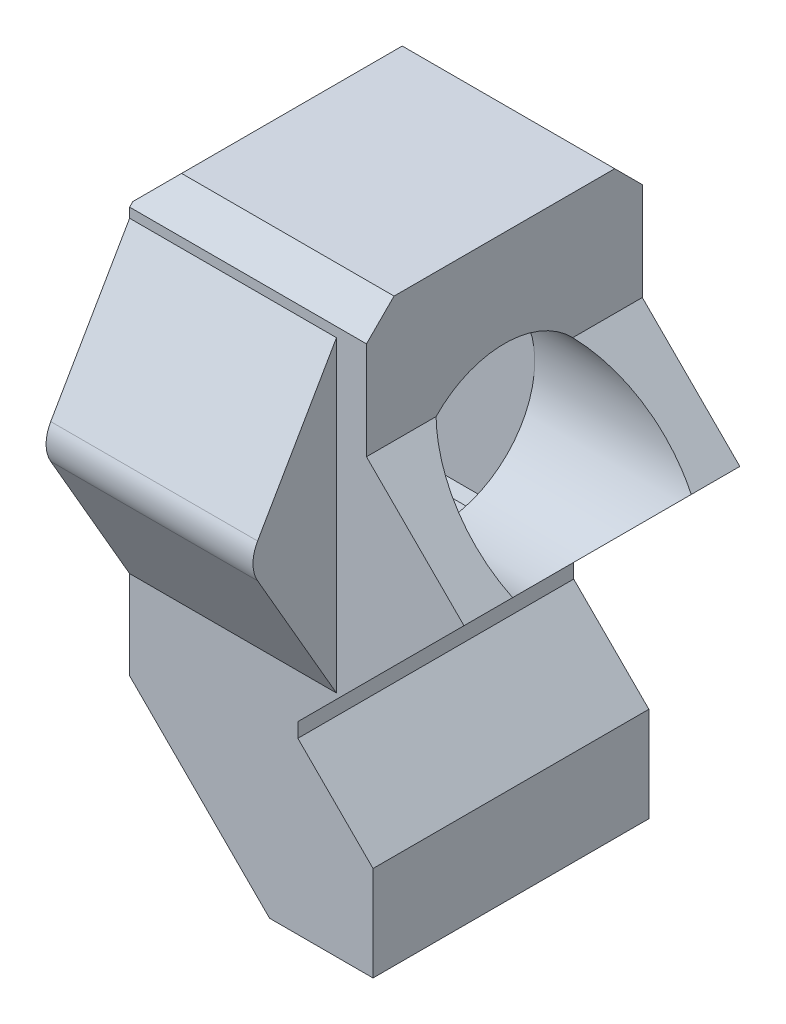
ISO-10303-21;
HEADER;
FILE_DESCRIPTION(('STEP AP214'),'2;1');
FILE_NAME('part.step','',(''),(''),'','','');
FILE_SCHEMA(('AUTOMOTIVE_DESIGN { 1 0 10303 214 1 1 1 1 }'));
ENDSEC;
DATA;
#1=APPLICATION_CONTEXT('core data for automotive mechanical design processes');
#2=APPLICATION_PROTOCOL_DEFINITION('international standard','automotive_design',2000,#1);
#3=PRODUCT_CONTEXT('',#1,'mechanical');
#4=PRODUCT('Part','Part','',(#3));
#5=PRODUCT_RELATED_PRODUCT_CATEGORY('part','',(#4));
#6=PRODUCT_DEFINITION_FORMATION('','',#4);
#7=PRODUCT_DEFINITION_CONTEXT('part definition',#1,'design');
#8=PRODUCT_DEFINITION('design','',#6,#7);
#9=PRODUCT_DEFINITION_SHAPE('','',#8);
#10=(LENGTH_UNIT() NAMED_UNIT(*) SI_UNIT(.MILLI.,.METRE.));
#11=(NAMED_UNIT(*) PLANE_ANGLE_UNIT() SI_UNIT($,.RADIAN.));
#12=(NAMED_UNIT(*) SI_UNIT($,.STERADIAN.) SOLID_ANGLE_UNIT());
#13=UNCERTAINTY_MEASURE_WITH_UNIT(LENGTH_MEASURE(1.E-05),#10,'distance_accuracy_value','');
#14=(GEOMETRIC_REPRESENTATION_CONTEXT(3) GLOBAL_UNCERTAINTY_ASSIGNED_CONTEXT((#13)) GLOBAL_UNIT_ASSIGNED_CONTEXT((#10,
#11,#12)) REPRESENTATION_CONTEXT('',''));
#15=CARTESIAN_POINT('',(0.,0.,0.));
#16=DIRECTION('',(0.,0.,1.));
#17=DIRECTION('',(1.,0.,0.));
#18=AXIS2_PLACEMENT_3D('',#15,#16,#17);
#19=CARTESIAN_POINT('',(79.1992941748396,14.5959743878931,17.7779058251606));
#20=DIRECTION('',(0.,0.,-1.));
#21=DIRECTION('',(-1.,0.,0.));
#22=AXIS2_PLACEMENT_3D('',#19,#20,#21);
#23=PLANE('',#22);
#24=DIRECTION('',(1.,0.,0.));
#25=VECTOR('',#24,1.);
#26=CARTESIAN_POINT('',(-9.4217749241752,13.223875,17.7779058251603));
#27=LINE('',#26,#25);
#28=CARTESIAN_POINT('',(2.99929417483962,13.223875,17.7779058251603));
#29=VERTEX_POINT('',#28);
#30=CARTESIAN_POINT('',(10.6192941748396,13.223875,17.7779058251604));
#31=VERTEX_POINT('',#30);
#32=EDGE_CURVE('E228',#29,#31,#27,.T.);
#33=ORIENTED_EDGE('',*,*,#32,.T.);
#34=DIRECTION('',(0.,1.,0.));
#35=VECTOR('',#34,1.);
#36=CARTESIAN_POINT('',(10.6192941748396,13.223875,17.7779058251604));
#37=LINE('',#36,#35);
#38=CARTESIAN_POINT('',(10.6192941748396,1.889125,17.7779058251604));
#39=VERTEX_POINT('',#38);
#40=EDGE_CURVE('E232',#39,#31,#37,.T.);
#41=ORIENTED_EDGE('',*,*,#40,.F.);
#42=DIRECTION('',(1.,0.,0.));
#43=VECTOR('',#42,1.);
#44=CARTESIAN_POINT('',(-9.4217749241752,1.889125,17.7779058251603));
#45=LINE('',#44,#43);
#46=CARTESIAN_POINT('',(2.99929417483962,1.889125,17.7779058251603));
#47=VERTEX_POINT('',#46);
#48=EDGE_CURVE('E240',#47,#39,#45,.T.);
#49=ORIENTED_EDGE('',*,*,#48,.F.);
#50=DIRECTION('',(0.,-1.,0.));
#51=VECTOR('',#50,1.);
#52=CARTESIAN_POINT('',(2.99929417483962,14.5959743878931,17.7779058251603));
#53=LINE('',#52,#51);
#54=CARTESIAN_POINT('',(2.99929417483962,-1.3716,17.7779058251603));
#55=VERTEX_POINT('',#54);
#56=EDGE_CURVE('E315',#47,#55,#53,.T.);
#57=ORIENTED_EDGE('',*,*,#56,.T.);
#58=DIRECTION('',(-0.707106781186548,0.707106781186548,0.));
#59=VECTOR('',#58,1.);
#60=CARTESIAN_POINT('',(8.15549417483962,-6.5278,17.7779058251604));
#61=LINE('',#60,#59);
#62=CARTESIAN_POINT('',(8.15549417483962,-6.5278,17.7779058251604));
#63=VERTEX_POINT('',#62);
#64=EDGE_CURVE('E379',#63,#55,#61,.T.);
#65=ORIENTED_EDGE('',*,*,#64,.F.);
#66=DIRECTION('',(-1.,0.,0.));
#67=VECTOR('',#66,1.);
#68=CARTESIAN_POINT('',(11.9654941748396,-6.5278,17.7779058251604));
#69=LINE('',#68,#67);
#70=CARTESIAN_POINT('',(11.9654941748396,-6.5278,17.7779058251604));
#71=VERTEX_POINT('',#70);
#72=EDGE_CURVE('E375',#71,#63,#69,.T.);
#73=ORIENTED_EDGE('',*,*,#72,.F.);
#74=DIRECTION('',(0.,-1.,0.));
#75=VECTOR('',#74,1.);
#76=CARTESIAN_POINT('',(11.9654941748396,-3.03530000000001,17.7779058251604));
#77=LINE('',#76,#75);
#78=CARTESIAN_POINT('',(11.9654941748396,-3.03530000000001,17.7779058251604));
#79=VERTEX_POINT('',#78);
#80=EDGE_CURVE('E371',#79,#71,#77,.T.);
#81=ORIENTED_EDGE('',*,*,#80,.F.);
#82=DIRECTION('',(0.707106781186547,-0.707106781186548,0.));
#83=VECTOR('',#82,1.);
#84=CARTESIAN_POINT('',(9.19689417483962,-0.266700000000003,17.7779058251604));
#85=LINE('',#84,#83);
#86=CARTESIAN_POINT('',(9.19689417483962,-0.266700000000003,17.7779058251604));
#87=VERTEX_POINT('',#86);
#88=EDGE_CURVE('E367',#87,#79,#85,.T.);
#89=ORIENTED_EDGE('',*,*,#88,.F.);
#90=DIRECTION('',(0.,-1.,0.));
#91=VECTOR('',#90,1.);
#92=CARTESIAN_POINT('',(9.19689417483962,0.266699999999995,17.7779058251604));
#93=LINE('',#92,#91);
#94=CARTESIAN_POINT('',(9.19689417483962,0.266699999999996,17.7779058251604));
#95=VERTEX_POINT('',#94);
#96=EDGE_CURVE('E363',#95,#87,#93,.T.);
#97=ORIENTED_EDGE('',*,*,#96,.F.);
#98=DIRECTION('',(-0.707106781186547,-0.707106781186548,0.));
#99=VECTOR('',#98,1.);
#100=CARTESIAN_POINT('',(15.3162966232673,6.38610244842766,17.7779058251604));
#101=LINE('',#100,#99);
#102=CARTESIAN_POINT('',(15.3162966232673,6.38610244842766,17.7779058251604));
#103=VERTEX_POINT('',#102);
#104=EDGE_CURVE('E359',#103,#95,#101,.T.);
#105=ORIENTED_EDGE('',*,*,#104,.F.);
#106=DIRECTION('',(0.707106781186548,-0.707106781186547,0.));
#107=VECTOR('',#106,1.);
#108=CARTESIAN_POINT('',(11.7241941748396,9.97820489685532,17.7779058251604));
#109=LINE('',#108,#107);
#110=CARTESIAN_POINT('',(11.7241941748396,9.97820489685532,17.7779058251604));
#111=VERTEX_POINT('',#110);
#112=EDGE_CURVE('E352',#111,#103,#109,.T.);
#113=ORIENTED_EDGE('',*,*,#112,.F.);
#114=DIRECTION('',(0.,-1.,0.));
#115=VECTOR('',#114,1.);
#116=CARTESIAN_POINT('',(11.7241941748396,12.319,17.7779058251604));
#117=LINE('',#116,#115);
#118=CARTESIAN_POINT('',(11.7241941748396,13.5799743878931,17.7779058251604));
#119=VERTEX_POINT('',#118);
#120=EDGE_CURVE('E356',#119,#111,#117,.T.);
#121=ORIENTED_EDGE('',*,*,#120,.F.);
#122=DIRECTION('',(-1.,0.,0.));
#123=VECTOR('',#122,1.);
#124=CARTESIAN_POINT('',(79.1992941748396,13.5799743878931,17.7779058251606));
#125=LINE('',#124,#123);
#126=CARTESIAN_POINT('',(2.99929417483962,13.5799743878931,17.7779058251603));
#127=VERTEX_POINT('',#126);
#128=EDGE_CURVE('E504',#119,#127,#125,.T.);
#129=ORIENTED_EDGE('',*,*,#128,.T.);
#130=EDGE_CURVE('E235',#127,#29,#53,.T.);
#131=ORIENTED_EDGE('',*,*,#130,.T.);
#132=EDGE_LOOP('',(#33,#41,#49,#57,#65,#73,#81,#89,#97,#105,#113,#121,#129,#131));
#133=FACE_BOUND('',#132,.T.);
#134=ADVANCED_FACE('F53',(#133),#23,.F.);
#135=CARTESIAN_POINT('',(9.34929417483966,0.,5.07790582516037));
#136=DIRECTION('',(-1.,0.,0.));
#137=DIRECTION('',(0.,0.,1.));
#138=AXIS2_PLACEMENT_3D('',#135,#136,#137);
#139=PLANE('',#138);
#140=DIRECTION('',(0.,-0.866025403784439,-0.499999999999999));
#141=VECTOR('',#140,1.);
#142=CARTESIAN_POINT('',(9.34929417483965,13.223875,9.42584534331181));
#143=LINE('',#142,#141);
#144=CARTESIAN_POINT('',(9.34929417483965,13.223875,9.42584534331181));
#145=VERTEX_POINT('',#144);
#146=CARTESIAN_POINT('',(9.34929417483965,12.8420625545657,9.20540582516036));
#147=VERTEX_POINT('',#146);
#148=EDGE_CURVE('E438',#145,#147,#143,.T.);
#149=ORIENTED_EDGE('',*,*,#148,.T.);
#150=DIRECTION('',(0.,1.,0.));
#151=VECTOR('',#150,1.);
#152=CARTESIAN_POINT('',(9.34929417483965,12.8420625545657,9.20540582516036));
#153=LINE('',#152,#151);
#154=CARTESIAN_POINT('',(9.34929417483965,7.5565,9.20540582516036));
#155=VERTEX_POINT('',#154);
#156=EDGE_CURVE('E264',#155,#147,#153,.T.);
#157=ORIENTED_EDGE('',*,*,#156,.F.);
#158=CARTESIAN_POINT('',(9.34929417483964,7.5565,12.6979058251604));
#159=DIRECTION('',(-1.,0.,0.));
#160=DIRECTION('',(0.,0.,1.));
#161=AXIS2_PLACEMENT_3D('',#158,#159,#160);
#162=CIRCLE('',#161,3.4925);
#163=EDGE_CURVE('E391',#155,#155,#162,.F.);
#164=ORIENTED_EDGE('',*,*,#163,.T.);
#165=CARTESIAN_POINT('',(9.34929417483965,2.27093744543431,9.20540582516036));
#166=VERTEX_POINT('',#165);
#167=EDGE_CURVE('E275',#166,#155,#153,.T.);
#168=ORIENTED_EDGE('',*,*,#167,.F.);
#169=DIRECTION('',(0.,-0.866025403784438,0.5));
#170=VECTOR('',#169,1.);
#171=CARTESIAN_POINT('',(9.34929417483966,7.5565,6.15378486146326));
#172=LINE('',#171,#170);
#173=CARTESIAN_POINT('',(9.34929417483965,1.889125,9.42584534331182));
#174=VERTEX_POINT('',#173);
#175=EDGE_CURVE('E442',#166,#174,#172,.T.);
#176=ORIENTED_EDGE('',*,*,#175,.T.);
#177=DIRECTION('',(0.,0.,1.));
#178=VECTOR('',#177,1.);
#179=CARTESIAN_POINT('',(9.34929417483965,1.889125,9.42584534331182));
#180=LINE('',#179,#178);
#181=CARTESIAN_POINT('',(9.34929417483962,1.889125,15.9699663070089));
#182=VERTEX_POINT('',#181);
#183=EDGE_CURVE('E445',#174,#182,#180,.T.);
#184=ORIENTED_EDGE('',*,*,#183,.T.);
#185=DIRECTION('',(0.,0.866025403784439,0.499999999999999));
#186=VECTOR('',#185,1.);
#187=CARTESIAN_POINT('',(9.34929417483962,1.889125,15.9699663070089));
#188=LINE('',#187,#186);
#189=CARTESIAN_POINT('',(9.34929417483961,7.55650000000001,19.2420267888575));
#190=VERTEX_POINT('',#189);
#191=EDGE_CURVE('E449',#182,#190,#188,.T.);
#192=ORIENTED_EDGE('',*,*,#191,.T.);
#193=DIRECTION('',(0.,0.866025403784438,-0.5));
#194=VECTOR('',#193,1.);
#195=CARTESIAN_POINT('',(9.34929417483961,7.5565,19.2420267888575));
#196=LINE('',#195,#194);
#197=CARTESIAN_POINT('',(9.34929417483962,13.223875,15.9699663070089));
#198=VERTEX_POINT('',#197);
#199=EDGE_CURVE('E411',#190,#198,#196,.T.);
#200=ORIENTED_EDGE('',*,*,#199,.T.);
#201=DIRECTION('',(0.,0.,-1.));
#202=VECTOR('',#201,1.);
#203=CARTESIAN_POINT('',(9.34929417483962,13.223875,15.9699663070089));
#204=LINE('',#203,#202);
#205=EDGE_CURVE('E434',#198,#145,#204,.T.);
#206=ORIENTED_EDGE('',*,*,#205,.T.);
#207=EDGE_LOOP('',(#149,#157,#164,#168,#176,#184,#192,#200,#206));
#208=FACE_BOUND('',#207,.T.);
#209=ADVANCED_FACE('F532',(#208),#139,.T.);
#210=CARTESIAN_POINT('',(-14.3148224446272,7.5565,6.15378486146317));
#211=DIRECTION('',(0.,0.5,0.866025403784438));
#212=DIRECTION('',(0.,0.866025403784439,-0.5));
#213=AXIS2_PLACEMENT_3D('',#210,#211,#212);
#214=PLANE('',#213);
#215=ORIENTED_EDGE('',*,*,#175,.F.);
#216=DIRECTION('',(1.,0.,0.));
#217=VECTOR('',#216,1.);
#218=CARTESIAN_POINT('',(-7.69036635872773,2.27093744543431,9.20540582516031));
#219=LINE('',#218,#217);
#220=CARTESIAN_POINT('',(2.99929417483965,2.27093744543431,9.20540582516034));
#221=VERTEX_POINT('',#220);
#222=EDGE_CURVE('E274',#221,#166,#219,.T.);
#223=ORIENTED_EDGE('',*,*,#222,.F.);
#224=DIRECTION('',(0.,0.866025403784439,-0.5));
#225=VECTOR('',#224,1.);
#226=CARTESIAN_POINT('',(2.99929417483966,7.5565,6.15378486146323));
#227=LINE('',#226,#225);
#228=CARTESIAN_POINT('',(2.99929417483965,1.889125,9.42584534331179));
#229=VERTEX_POINT('',#228);
#230=EDGE_CURVE('E416',#229,#221,#227,.T.);
#231=ORIENTED_EDGE('',*,*,#230,.F.);
#232=DIRECTION('',(1.,0.,0.));
#233=VECTOR('',#232,1.);
#234=CARTESIAN_POINT('',(-14.3148224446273,1.889125,9.42584534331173));
#235=LINE('',#234,#233);
#236=EDGE_CURVE('E456',#229,#174,#235,.T.);
#237=ORIENTED_EDGE('',*,*,#236,.T.);
#238=EDGE_LOOP('',(#215,#223,#231,#237));
#239=FACE_BOUND('',#238,.T.);
#240=ADVANCED_FACE('F545',(#239),#214,.T.);
#241=CARTESIAN_POINT('',(-14.3148224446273,13.223875,9.42584534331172));
#242=DIRECTION('',(0.,-0.499999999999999,0.866025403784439));
#243=DIRECTION('',(0.,0.866025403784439,0.5));
#244=AXIS2_PLACEMENT_3D('',#241,#242,#243);
#245=PLANE('',#244);
#246=DIRECTION('',(0.,0.866025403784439,0.5));
#247=VECTOR('',#246,1.);
#248=CARTESIAN_POINT('',(2.99929417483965,13.223875,9.42584534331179));
#249=LINE('',#248,#247);
#250=CARTESIAN_POINT('',(2.99929417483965,12.8420625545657,9.20540582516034));
#251=VERTEX_POINT('',#250);
#252=CARTESIAN_POINT('',(2.99929417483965,13.223875,9.42584534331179));
#253=VERTEX_POINT('',#252);
#254=EDGE_CURVE('E421',#251,#253,#249,.T.);
#255=ORIENTED_EDGE('',*,*,#254,.F.);
#256=DIRECTION('',(1.,0.,0.));
#257=VECTOR('',#256,1.);
#258=CARTESIAN_POINT('',(-7.69036635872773,12.8420625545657,9.20540582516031));
#259=LINE('',#258,#257);
#260=EDGE_CURVE('E278',#251,#147,#259,.T.);
#261=ORIENTED_EDGE('',*,*,#260,.T.);
#262=ORIENTED_EDGE('',*,*,#148,.F.);
#263=DIRECTION('',(1.,0.,0.));
#264=VECTOR('',#263,1.);
#265=CARTESIAN_POINT('',(-14.3148224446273,13.223875,9.42584534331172));
#266=LINE('',#265,#264);
#267=EDGE_CURVE('E460',#253,#145,#266,.T.);
#268=ORIENTED_EDGE('',*,*,#267,.F.);
#269=EDGE_LOOP('',(#255,#261,#262,#268));
#270=FACE_BOUND('',#269,.T.);
#271=ADVANCED_FACE('F530',(#270),#245,.T.);
#272=CARTESIAN_POINT('',(2.99929417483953,-1.3716,42.832577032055));
#273=DIRECTION('',(1.,0.,0.));
#274=DIRECTION('',(0.,0.,-1.));
#275=AXIS2_PLACEMENT_3D('',#272,#273,#274);
#276=PLANE('',#275);
#277=DIRECTION('',(0.,0.,1.));
#278=VECTOR('',#277,1.);
#279=CARTESIAN_POINT('',(2.99929417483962,13.223875,15.9699663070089));
#280=LINE('',#279,#278);
#281=CARTESIAN_POINT('',(2.99929417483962,13.223875,15.9699663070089));
#282=VERTEX_POINT('',#281);
#283=EDGE_CURVE('E424',#253,#282,#280,.T.);
#284=ORIENTED_EDGE('',*,*,#283,.T.);
#285=DIRECTION('',(0.,-0.866025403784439,0.5));
#286=VECTOR('',#285,1.);
#287=CARTESIAN_POINT('',(2.99929417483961,7.5565,19.2420267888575));
#288=LINE('',#287,#286);
#289=CARTESIAN_POINT('',(2.99929417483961,7.55650000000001,19.2420267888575));
#290=VERTEX_POINT('',#289);
#291=EDGE_CURVE('E428',#282,#290,#288,.T.);
#292=ORIENTED_EDGE('',*,*,#291,.T.);
#293=DIRECTION('',(0.,-0.866025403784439,-0.5));
#294=VECTOR('',#293,1.);
#295=CARTESIAN_POINT('',(2.99929417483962,1.889125,15.9699663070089));
#296=LINE('',#295,#294);
#297=CARTESIAN_POINT('',(2.99929417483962,1.889125,15.9699663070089));
#298=VERTEX_POINT('',#297);
#299=EDGE_CURVE('E417',#290,#298,#296,.T.);
#300=ORIENTED_EDGE('',*,*,#299,.T.);
#301=DIRECTION('',(0.,0.,-1.));
#302=VECTOR('',#301,1.);
#303=CARTESIAN_POINT('',(2.99929417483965,1.889125,9.42584534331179));
#304=LINE('',#303,#302);
#305=EDGE_CURVE('E412',#298,#229,#304,.T.);
#306=ORIENTED_EDGE('',*,*,#305,.T.);
#307=ORIENTED_EDGE('',*,*,#230,.T.);
#308=DIRECTION('',(0.,-1.,0.));
#309=VECTOR('',#308,1.);
#310=CARTESIAN_POINT('',(2.99929417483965,12.8420625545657,9.20540582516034));
#311=LINE('',#310,#309);
#312=EDGE_CURVE('E270',#251,#221,#311,.T.);
#313=ORIENTED_EDGE('',*,*,#312,.F.);
#314=ORIENTED_EDGE('',*,*,#254,.T.);
#315=EDGE_LOOP('',(#284,#292,#300,#306,#307,#313,#314));
#316=FACE_BOUND('',#315,.T.);
#317=DIRECTION('',(0.,-0.866025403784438,-0.500000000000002));
#318=VECTOR('',#317,1.);
#319=CARTESIAN_POINT('',(2.99929417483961,7.55650000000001,21.0499663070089));
#320=LINE('',#319,#318);
#321=CARTESIAN_POINT('',(2.99929417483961,6.92150000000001,20.6833488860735));
#322=VERTEX_POINT('',#321);
#323=EDGE_CURVE('E261',#322,#47,#320,.T.);
#324=ORIENTED_EDGE('',*,*,#323,.F.);
#325=CARTESIAN_POINT('',(2.99929417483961,7.55650000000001,19.5834966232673));
#326=DIRECTION('',(1.,0.,0.));
#327=DIRECTION('',(0.,0.,-1.));
#328=AXIS2_PLACEMENT_3D('',#325,#326,#327);
#329=CIRCLE('',#328,1.27);
#330=CARTESIAN_POINT('',(2.99929417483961,8.19150000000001,20.6833488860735));
#331=VERTEX_POINT('',#330);
#332=EDGE_CURVE('E12',#322,#331,#329,.F.);
#333=ORIENTED_EDGE('',*,*,#332,.T.);
#334=DIRECTION('',(0.,-0.866025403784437,0.500000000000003));
#335=VECTOR('',#334,1.);
#336=CARTESIAN_POINT('',(2.99929417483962,13.223875,17.7779058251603));
#337=LINE('',#336,#335);
#338=EDGE_CURVE('E258',#29,#331,#337,.T.);
#339=ORIENTED_EDGE('',*,*,#338,.F.);
#340=ORIENTED_EDGE('',*,*,#130,.F.);
#341=DIRECTION('',(0.,0.707106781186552,-0.707106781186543));
#342=VECTOR('',#341,1.);
#343=CARTESIAN_POINT('',(2.99929417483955,-6.4231484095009,37.7810286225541));
#344=LINE('',#343,#342);
#345=CARTESIAN_POINT('',(2.99929417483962,13.6979487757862,17.6599314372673));
#346=VERTEX_POINT('',#345);
#347=EDGE_CURVE('E294',#127,#346,#344,.T.);
#348=ORIENTED_EDGE('',*,*,#347,.T.);
#349=DIRECTION('',(0.,0.,-1.));
#350=VECTOR('',#349,1.);
#351=CARTESIAN_POINT('',(2.99929417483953,13.6979487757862,43.6184851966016));
#352=LINE('',#351,#350);
#353=CARTESIAN_POINT('',(2.99929417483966,13.6979487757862,7.73588021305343));
#354=VERTEX_POINT('',#353);
#355=EDGE_CURVE('E431',#346,#354,#352,.T.);
#356=ORIENTED_EDGE('',*,*,#355,.T.);
#357=DIRECTION('',(0.,-0.707106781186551,-0.707106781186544));
#358=VECTOR('',#357,1.);
#359=CARTESIAN_POINT('',(2.99929417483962,23.7115227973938,17.749454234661));
#360=LINE('',#359,#358);
#361=CARTESIAN_POINT('',(2.99929417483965,13.5799743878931,7.61790582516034));
#362=VERTEX_POINT('',#361);
#363=EDGE_CURVE('E306',#354,#362,#360,.T.);
#364=ORIENTED_EDGE('',*,*,#363,.T.);
#365=DIRECTION('',(0.,1.,0.));
#366=VECTOR('',#365,1.);
#367=CARTESIAN_POINT('',(2.99929417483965,14.5959743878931,7.61790582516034));
#368=LINE('',#367,#366);
#369=CARTESIAN_POINT('',(2.99929417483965,-1.3716,7.61790582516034));
#370=VERTEX_POINT('',#369);
#371=EDGE_CURVE('E314',#370,#362,#368,.T.);
#372=ORIENTED_EDGE('',*,*,#371,.F.);
#373=DIRECTION('',(0.,0.,-1.));
#374=VECTOR('',#373,1.);
#375=CARTESIAN_POINT('',(2.99929417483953,-1.3716,42.832577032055));
#376=LINE('',#375,#374);
#377=EDGE_CURVE('E496',#55,#370,#376,.T.);
#378=ORIENTED_EDGE('',*,*,#377,.F.);
#379=ORIENTED_EDGE('',*,*,#56,.F.);
#380=EDGE_LOOP('',(#324,#333,#339,#340,#348,#356,#364,#372,#378,#379));
#381=FACE_BOUND('',#380,.T.);
#382=ADVANCED_FACE('F539',(#316,#381),#276,.F.);
#383=CARTESIAN_POINT('',(11.7241941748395,9.97820489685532,42.8325770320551));
#384=DIRECTION('',(-0.707106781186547,-0.707106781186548,0.));
#385=DIRECTION('',(0.707106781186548,-0.707106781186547,0.));
#386=AXIS2_PLACEMENT_3D('',#383,#384,#385);
#387=PLANE('',#386);
#388=DIRECTION('',(0.,0.,-1.));
#389=VECTOR('',#388,1.);
#390=CARTESIAN_POINT('',(15.3162966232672,6.38610244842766,42.8325770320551));
#391=LINE('',#390,#389);
#392=CARTESIAN_POINT('',(15.3162966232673,6.38610244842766,9.40735483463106));
#393=VERTEX_POINT('',#392);
#394=CARTESIAN_POINT('',(15.3162966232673,6.38610244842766,7.61790582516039));
#395=VERTEX_POINT('',#394);
#396=EDGE_CURVE('E472',#393,#395,#391,.T.);
#397=ORIENTED_EDGE('',*,*,#396,.T.);
#398=DIRECTION('',(-0.707106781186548,0.707106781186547,0.));
#399=VECTOR('',#398,1.);
#400=CARTESIAN_POINT('',(11.7241941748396,9.97820489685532,7.61790582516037));
#401=LINE('',#400,#399);
#402=CARTESIAN_POINT('',(11.7241941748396,9.97820489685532,7.61790582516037));
#403=VERTEX_POINT('',#402);
#404=EDGE_CURVE('E324',#395,#403,#401,.T.);
#405=ORIENTED_EDGE('',*,*,#404,.T.);
#406=DIRECTION('',(0.,0.,-1.));
#407=VECTOR('',#406,1.);
#408=CARTESIAN_POINT('',(11.7241941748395,9.97820489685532,42.8325770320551));
#409=LINE('',#408,#407);
#410=CARTESIAN_POINT('',(11.7241941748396,9.97820489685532,10.1813801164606));
#411=VERTEX_POINT('',#410);
#412=EDGE_CURVE('E500',#411,#403,#409,.T.);
#413=ORIENTED_EDGE('',*,*,#412,.F.);
#414=CARTESIAN_POINT('',(14.145899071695,7.5565,12.6979058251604));
#415=DIRECTION('',(-0.707106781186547,-0.707106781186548,0.));
#416=DIRECTION('',(0.707106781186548,-0.707106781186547,0.));
#417=AXIS2_PLACEMENT_3D('',#414,#415,#416);
#418=ELLIPSE('',#417,4.93914086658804,3.4925);
#419=EDGE_CURVE('E407',#411,#393,#418,.T.);
#420=ORIENTED_EDGE('',*,*,#419,.T.);
#421=EDGE_LOOP('',(#397,#405,#413,#420));
#422=FACE_BOUND('',#421,.T.);
#423=ADVANCED_FACE('F571',(#422),#387,.F.);
#424=CARTESIAN_POINT('',(15.3162966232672,6.38610244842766,42.8325770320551));
#425=DIRECTION('',(-0.707106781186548,0.707106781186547,0.));
#426=DIRECTION('',(-0.707106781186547,-0.707106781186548,0.));
#427=AXIS2_PLACEMENT_3D('',#424,#425,#426);
#428=PLANE('',#427);
#429=CARTESIAN_POINT('',(15.3162966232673,6.38610244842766,15.9884568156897));
#430=VERTEX_POINT('',#429);
#431=EDGE_CURVE('E473',#103,#430,#391,.T.);
#432=ORIENTED_EDGE('',*,*,#431,.F.);
#433=ORIENTED_EDGE('',*,*,#104,.T.);
#434=DIRECTION('',(0.,0.,-1.));
#435=VECTOR('',#434,1.);
#436=CARTESIAN_POINT('',(9.19689417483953,0.266699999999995,42.8325770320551));
#437=LINE('',#436,#435);
#438=CARTESIAN_POINT('',(9.19689417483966,0.266699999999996,7.61790582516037));
#439=VERTEX_POINT('',#438);
#440=EDGE_CURVE('E476',#95,#439,#437,.T.);
#441=ORIENTED_EDGE('',*,*,#440,.T.);
#442=DIRECTION('',(0.707106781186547,0.707106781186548,0.));
#443=VECTOR('',#442,1.);
#444=CARTESIAN_POINT('',(15.3162966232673,6.38610244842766,7.61790582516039));
#445=LINE('',#444,#443);
#446=EDGE_CURVE('E328',#439,#395,#445,.T.);
#447=ORIENTED_EDGE('',*,*,#446,.T.);
#448=ORIENTED_EDGE('',*,*,#396,.F.);
#449=CARTESIAN_POINT('',(16.4866941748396,7.5565,12.6979058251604));
#450=DIRECTION('',(-0.707106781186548,0.707106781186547,0.));
#451=DIRECTION('',(0.707106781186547,0.707106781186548,0.));
#452=AXIS2_PLACEMENT_3D('',#449,#450,#451);
#453=ELLIPSE('',#452,4.93914086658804,3.4925);
#454=EDGE_CURVE('E403',#393,#430,#453,.T.);
#455=ORIENTED_EDGE('',*,*,#454,.T.);
#456=EDGE_LOOP('',(#432,#433,#441,#447,#448,#455));
#457=FACE_BOUND('',#456,.T.);
#458=ADVANCED_FACE('F567',(#457),#428,.F.);
#459=CARTESIAN_POINT('',(9.19689417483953,0.266699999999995,42.8325770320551));
#460=DIRECTION('',(-1.,0.,0.));
#461=DIRECTION('',(0.,0.,1.));
#462=AXIS2_PLACEMENT_3D('',#459,#460,#461);
#463=PLANE('',#462);
#464=ORIENTED_EDGE('',*,*,#440,.F.);
#465=ORIENTED_EDGE('',*,*,#96,.T.);
#466=DIRECTION('',(0.,0.,-1.));
#467=VECTOR('',#466,1.);
#468=CARTESIAN_POINT('',(9.19689417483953,-0.266700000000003,42.8325770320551));
#469=LINE('',#468,#467);
#470=CARTESIAN_POINT('',(9.19689417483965,-0.266700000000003,7.61790582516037));
#471=VERTEX_POINT('',#470);
#472=EDGE_CURVE('E480',#87,#471,#469,.T.);
#473=ORIENTED_EDGE('',*,*,#472,.T.);
#474=DIRECTION('',(0.,1.,0.));
#475=VECTOR('',#474,1.);
#476=CARTESIAN_POINT('',(9.19689417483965,0.266699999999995,7.61790582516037));
#477=LINE('',#476,#475);
#478=EDGE_CURVE('E332',#471,#439,#477,.T.);
#479=ORIENTED_EDGE('',*,*,#478,.T.);
#480=EDGE_LOOP('',(#464,#465,#473,#479));
#481=FACE_BOUND('',#480,.T.);
#482=ADVANCED_FACE('F591',(#481),#463,.F.);
#483=CARTESIAN_POINT('',(9.19689417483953,-0.266700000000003,42.8325770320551));
#484=DIRECTION('',(-0.707106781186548,-0.707106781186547,0.));
#485=DIRECTION('',(0.707106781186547,-0.707106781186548,0.));
#486=AXIS2_PLACEMENT_3D('',#483,#484,#485);
#487=PLANE('',#486);
#488=ORIENTED_EDGE('',*,*,#472,.F.);
#489=ORIENTED_EDGE('',*,*,#88,.T.);
#490=DIRECTION('',(0.,0.,-1.));
#491=VECTOR('',#490,1.);
#492=CARTESIAN_POINT('',(11.9654941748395,-3.03530000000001,42.8325770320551));
#493=LINE('',#492,#491);
#494=CARTESIAN_POINT('',(11.9654941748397,-3.03530000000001,7.61790582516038));
#495=VERTEX_POINT('',#494);
#496=EDGE_CURVE('E484',#79,#495,#493,.T.);
#497=ORIENTED_EDGE('',*,*,#496,.T.);
#498=DIRECTION('',(-0.707106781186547,0.707106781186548,0.));
#499=VECTOR('',#498,1.);
#500=CARTESIAN_POINT('',(9.19689417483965,-0.266700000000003,7.61790582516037));
#501=LINE('',#500,#499);
#502=EDGE_CURVE('E336',#495,#471,#501,.T.);
#503=ORIENTED_EDGE('',*,*,#502,.T.);
#504=EDGE_LOOP('',(#488,#489,#497,#503));
#505=FACE_BOUND('',#504,.T.);
#506=ADVANCED_FACE('F593',(#505),#487,.F.);
#507=CARTESIAN_POINT('',(11.9654941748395,-3.03530000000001,42.8325770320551));
#508=DIRECTION('',(-1.,0.,0.));
#509=DIRECTION('',(0.,0.,1.));
#510=AXIS2_PLACEMENT_3D('',#507,#508,#509);
#511=PLANE('',#510);
#512=ORIENTED_EDGE('',*,*,#496,.F.);
#513=ORIENTED_EDGE('',*,*,#80,.T.);
#514=DIRECTION('',(0.,0.,-1.));
#515=VECTOR('',#514,1.);
#516=CARTESIAN_POINT('',(11.9654941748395,-6.5278,42.8325770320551));
#517=LINE('',#516,#515);
#518=CARTESIAN_POINT('',(11.9654941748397,-6.5278,7.61790582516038));
#519=VERTEX_POINT('',#518);
#520=EDGE_CURVE('E488',#71,#519,#517,.T.);
#521=ORIENTED_EDGE('',*,*,#520,.T.);
#522=DIRECTION('',(0.,1.,0.));
#523=VECTOR('',#522,1.);
#524=CARTESIAN_POINT('',(11.9654941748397,-3.03530000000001,7.61790582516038));
#525=LINE('',#524,#523);
#526=EDGE_CURVE('E340',#519,#495,#525,.T.);
#527=ORIENTED_EDGE('',*,*,#526,.T.);
#528=EDGE_LOOP('',(#512,#513,#521,#527));
#529=FACE_BOUND('',#528,.T.);
#530=ADVANCED_FACE('F596',(#529),#511,.F.);
#531=CARTESIAN_POINT('',(11.9654941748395,-6.5278,42.8325770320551));
#532=DIRECTION('',(0.,1.,0.));
#533=DIRECTION('',(-1.,0.,0.));
#534=AXIS2_PLACEMENT_3D('',#531,#532,#533);
#535=PLANE('',#534);
#536=ORIENTED_EDGE('',*,*,#520,.F.);
#537=ORIENTED_EDGE('',*,*,#72,.T.);
#538=DIRECTION('',(0.,0.,-1.));
#539=VECTOR('',#538,1.);
#540=CARTESIAN_POINT('',(8.15549417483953,-6.5278,42.832577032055));
#541=LINE('',#540,#539);
#542=CARTESIAN_POINT('',(8.15549417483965,-6.5278,7.61790582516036));
#543=VERTEX_POINT('',#542);
#544=EDGE_CURVE('E492',#63,#543,#541,.T.);
#545=ORIENTED_EDGE('',*,*,#544,.T.);
#546=DIRECTION('',(1.,0.,0.));
#547=VECTOR('',#546,1.);
#548=CARTESIAN_POINT('',(11.9654941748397,-6.5278,7.61790582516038));
#549=LINE('',#548,#547);
#550=EDGE_CURVE('E344',#543,#519,#549,.T.);
#551=ORIENTED_EDGE('',*,*,#550,.T.);
#552=EDGE_LOOP('',(#536,#537,#545,#551));
#553=FACE_BOUND('',#552,.T.);
#554=ADVANCED_FACE('F599',(#553),#535,.F.);
#555=CARTESIAN_POINT('',(8.15549417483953,-6.5278,42.832577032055));
#556=DIRECTION('',(0.707106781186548,0.707106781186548,0.));
#557=DIRECTION('',(-0.707106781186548,0.707106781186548,0.));
#558=AXIS2_PLACEMENT_3D('',#555,#556,#557);
#559=PLANE('',#558);
#560=ORIENTED_EDGE('',*,*,#544,.F.);
#561=ORIENTED_EDGE('',*,*,#64,.T.);
#562=ORIENTED_EDGE('',*,*,#377,.T.);
#563=DIRECTION('',(0.707106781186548,-0.707106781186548,0.));
#564=VECTOR('',#563,1.);
#565=CARTESIAN_POINT('',(8.15549417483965,-6.5278,7.61790582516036));
#566=LINE('',#565,#564);
#567=EDGE_CURVE('E348',#370,#543,#566,.T.);
#568=ORIENTED_EDGE('',*,*,#567,.T.);
#569=EDGE_LOOP('',(#560,#561,#562,#568));
#570=FACE_BOUND('',#569,.T.);
#571=ADVANCED_FACE('F602',(#570),#559,.F.);
#572=CARTESIAN_POINT('',(11.7241941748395,12.319,42.8325770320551));
#573=DIRECTION('',(-1.,0.,0.));
#574=DIRECTION('',(0.,0.,1.));
#575=AXIS2_PLACEMENT_3D('',#572,#573,#574);
#576=PLANE('',#575);
#577=DIRECTION('',(0.,0.,1.));
#578=VECTOR('',#577,1.);
#579=CARTESIAN_POINT('',(11.7241941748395,14.5959743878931,42.8325770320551));
#580=LINE('',#579,#578);
#581=CARTESIAN_POINT('',(11.7241941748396,14.5959743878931,8.63390582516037));
#582=VERTEX_POINT('',#581);
#583=CARTESIAN_POINT('',(11.7241941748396,14.5959743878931,16.7619058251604));
#584=VERTEX_POINT('',#583);
#585=EDGE_CURVE('E387',#582,#584,#580,.T.);
#586=ORIENTED_EDGE('',*,*,#585,.T.);
#587=DIRECTION('',(0.,-0.707106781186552,0.707106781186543));
#588=VECTOR('',#587,1.);
#589=CARTESIAN_POINT('',(11.7241941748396,0.422151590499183,30.9357286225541));
#590=LINE('',#589,#588);
#591=EDGE_CURVE('E298',#584,#119,#590,.T.);
#592=ORIENTED_EDGE('',*,*,#591,.T.);
#593=ORIENTED_EDGE('',*,*,#120,.T.);
#594=CARTESIAN_POINT('',(11.7241941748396,9.97820489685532,15.2144315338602));
#595=VERTEX_POINT('',#594);
#596=EDGE_CURVE('E501',#111,#595,#409,.T.);
#597=ORIENTED_EDGE('',*,*,#596,.T.);
#598=CARTESIAN_POINT('',(11.7241941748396,7.5565,12.6979058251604));
#599=DIRECTION('',(-1.,0.,0.));
#600=DIRECTION('',(0.,0.,1.));
#601=AXIS2_PLACEMENT_3D('',#598,#599,#600);
#602=CIRCLE('',#601,3.4925);
#603=EDGE_CURVE('E399',#595,#411,#602,.T.);
#604=ORIENTED_EDGE('',*,*,#603,.T.);
#605=ORIENTED_EDGE('',*,*,#412,.T.);
#606=DIRECTION('',(0.,1.,0.));
#607=VECTOR('',#606,1.);
#608=CARTESIAN_POINT('',(11.7241941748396,12.319,7.61790582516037));
#609=LINE('',#608,#607);
#610=CARTESIAN_POINT('',(11.7241941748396,13.5799743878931,7.61790582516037));
#611=VERTEX_POINT('',#610);
#612=EDGE_CURVE('E320',#403,#611,#609,.T.);
#613=ORIENTED_EDGE('',*,*,#612,.T.);
#614=DIRECTION('',(0.,0.707106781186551,0.707106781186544));
#615=VECTOR('',#614,1.);
#616=CARTESIAN_POINT('',(11.7241941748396,30.5568227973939,24.594754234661));
#617=LINE('',#616,#615);
#618=EDGE_CURVE('E310',#611,#582,#617,.T.);
#619=ORIENTED_EDGE('',*,*,#618,.T.);
#620=EDGE_LOOP('',(#586,#592,#593,#597,#604,#605,#613,#619));
#621=FACE_BOUND('',#620,.T.);
#622=ADVANCED_FACE('F572',(#621),#576,.F.);
#623=ORIENTED_EDGE('',*,*,#596,.F.);
#624=ORIENTED_EDGE('',*,*,#112,.T.);
#625=ORIENTED_EDGE('',*,*,#431,.T.);
#626=CARTESIAN_POINT('',(14.145899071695,7.5565,12.6979058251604));
#627=DIRECTION('',(-0.707106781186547,-0.707106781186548,0.));
#628=DIRECTION('',(0.707106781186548,-0.707106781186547,0.));
#629=AXIS2_PLACEMENT_3D('',#626,#627,#628);
#630=ELLIPSE('',#629,4.93914086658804,3.4925);
#631=EDGE_CURVE('E395',#430,#595,#630,.T.);
#632=ORIENTED_EDGE('',*,*,#631,.T.);
#633=EDGE_LOOP('',(#623,#624,#625,#632));
#634=FACE_BOUND('',#633,.T.);
#635=ADVANCED_FACE('F563',(#634),#387,.F.);
#636=CARTESIAN_POINT('',(2.99929417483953,13.6979487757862,43.6184851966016));
#637=DIRECTION('',(0.707106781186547,-0.707106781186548,0.));
#638=DIRECTION('',(0.707106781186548,0.707106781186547,0.));
#639=AXIS2_PLACEMENT_3D('',#636,#637,#638);
#640=PLANE('',#639);
#641=ORIENTED_EDGE('',*,*,#355,.F.);
#642=DIRECTION('',(0.577350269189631,0.577350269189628,-0.577350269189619));
#643=VECTOR('',#642,1.);
#644=CARTESIAN_POINT('',(-5.65355707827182,5.04509752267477,26.3127826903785));
#645=LINE('',#644,#643);
#646=CARTESIAN_POINT('',(3.89731978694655,14.5959743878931,16.7619058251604));
#647=VERTEX_POINT('',#646);
#648=EDGE_CURVE('E288',#346,#647,#645,.T.);
#649=ORIENTED_EDGE('',*,*,#648,.T.);
#650=DIRECTION('',(0.,0.,-1.));
#651=VECTOR('',#650,1.);
#652=CARTESIAN_POINT('',(3.89731978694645,14.5959743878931,43.6184851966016));
#653=LINE('',#652,#651);
#654=CARTESIAN_POINT('',(3.89731978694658,14.5959743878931,8.63390582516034));
#655=VERTEX_POINT('',#654);
#656=EDGE_CURVE('E383',#647,#655,#653,.T.);
#657=ORIENTED_EDGE('',*,*,#656,.T.);
#658=DIRECTION('',(-0.577350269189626,-0.577350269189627,-0.577350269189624));
#659=VECTOR('',#658,1.);
#660=CARTESIAN_POINT('',(14.960162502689,25.6588171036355,19.6967485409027));
#661=LINE('',#660,#659);
#662=EDGE_CURVE('E302',#655,#354,#661,.T.);
#663=ORIENTED_EDGE('',*,*,#662,.T.);
#664=EDGE_LOOP('',(#641,#649,#657,#663));
#665=FACE_BOUND('',#664,.T.);
#666=ADVANCED_FACE('F583',(#665),#640,.F.);
#667=CARTESIAN_POINT('',(-14.3148224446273,1.889125,15.9699663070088));
#668=DIRECTION('',(0.,0.499999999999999,-0.866025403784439));
#669=DIRECTION('',(0.,-0.866025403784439,-0.5));
#670=AXIS2_PLACEMENT_3D('',#667,#668,#669);
#671=PLANE('',#670);
#672=ORIENTED_EDGE('',*,*,#299,.F.);
#673=DIRECTION('',(1.,0.,0.));
#674=VECTOR('',#673,1.);
#675=CARTESIAN_POINT('',(-9.42177492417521,7.55650000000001,19.2420267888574));
#676=LINE('',#675,#674);
#677=EDGE_CURVE('E241',#290,#190,#676,.T.);
#678=ORIENTED_EDGE('',*,*,#677,.T.);
#679=ORIENTED_EDGE('',*,*,#191,.F.);
#680=DIRECTION('',(1.,0.,0.));
#681=VECTOR('',#680,1.);
#682=CARTESIAN_POINT('',(-14.3148224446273,1.889125,15.9699663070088));
#683=LINE('',#682,#681);
#684=EDGE_CURVE('E453',#298,#182,#683,.T.);
#685=ORIENTED_EDGE('',*,*,#684,.F.);
#686=EDGE_LOOP('',(#672,#678,#679,#685));
#687=FACE_BOUND('',#686,.T.);
#688=ADVANCED_FACE('F626',(#687),#671,.T.);
#689=CARTESIAN_POINT('',(-14.3148224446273,1.889125,9.42584534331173));
#690=DIRECTION('',(0.,1.,0.));
#691=DIRECTION('',(0.,0.,-1.));
#692=AXIS2_PLACEMENT_3D('',#689,#690,#691);
#693=PLANE('',#692);
#694=ORIENTED_EDGE('',*,*,#684,.T.);
#695=ORIENTED_EDGE('',*,*,#183,.F.);
#696=ORIENTED_EDGE('',*,*,#236,.F.);
#697=ORIENTED_EDGE('',*,*,#305,.F.);
#698=EDGE_LOOP('',(#694,#695,#696,#697));
#699=FACE_BOUND('',#698,.T.);
#700=ADVANCED_FACE('F629',(#699),#693,.T.);
#701=CARTESIAN_POINT('',(-14.3148224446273,13.223875,15.9699663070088));
#702=DIRECTION('',(0.,-1.,0.));
#703=DIRECTION('',(0.,0.,1.));
#704=AXIS2_PLACEMENT_3D('',#701,#702,#703);
#705=PLANE('',#704);
#706=ORIENTED_EDGE('',*,*,#267,.T.);
#707=ORIENTED_EDGE('',*,*,#205,.F.);
#708=DIRECTION('',(1.,0.,0.));
#709=VECTOR('',#708,1.);
#710=CARTESIAN_POINT('',(-14.3148224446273,13.223875,15.9699663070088));
#711=LINE('',#710,#709);
#712=EDGE_CURVE('E463',#282,#198,#711,.T.);
#713=ORIENTED_EDGE('',*,*,#712,.F.);
#714=ORIENTED_EDGE('',*,*,#283,.F.);
#715=EDGE_LOOP('',(#706,#707,#713,#714));
#716=FACE_BOUND('',#715,.T.);
#717=ADVANCED_FACE('F536',(#716),#705,.T.);
#718=CARTESIAN_POINT('',(-14.3148224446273,7.5565,19.2420267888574));
#719=DIRECTION('',(0.,-0.5,-0.866025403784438));
#720=DIRECTION('',(0.,-0.866025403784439,0.5));
#721=AXIS2_PLACEMENT_3D('',#718,#719,#720);
#722=PLANE('',#721);
#723=ORIENTED_EDGE('',*,*,#199,.F.);
#724=ORIENTED_EDGE('',*,*,#677,.F.);
#725=ORIENTED_EDGE('',*,*,#291,.F.);
#726=ORIENTED_EDGE('',*,*,#712,.T.);
#727=EDGE_LOOP('',(#723,#724,#725,#726));
#728=FACE_BOUND('',#727,.T.);
#729=ADVANCED_FACE('F555',(#728),#722,.T.);
#730=CARTESIAN_POINT('',(-0.528987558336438,7.5565,12.6979058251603));
#731=DIRECTION('',(1.,0.,0.));
#732=DIRECTION('',(0.,0.,-1.));
#733=AXIS2_PLACEMENT_3D('',#730,#731,#732);
#734=CYLINDRICAL_SURFACE('',#733,3.4925);
#735=ORIENTED_EDGE('',*,*,#163,.F.);
#736=EDGE_LOOP('',(#735));
#737=FACE_BOUND('',#736,.T.);
#738=ORIENTED_EDGE('',*,*,#603,.F.);
#739=ORIENTED_EDGE('',*,*,#631,.F.);
#740=ORIENTED_EDGE('',*,*,#454,.F.);
#741=ORIENTED_EDGE('',*,*,#419,.F.);
#742=EDGE_LOOP('',(#738,#739,#740,#741));
#743=FACE_BOUND('',#742,.T.);
#744=ADVANCED_FACE('F551',(#737,#743),#734,.F.);
#745=CARTESIAN_POINT('',(77.9491631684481,14.5959743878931,6.87395704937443));
#746=DIRECTION('',(0.,-1.,0.));
#747=DIRECTION('',(1.,0.,0.));
#748=AXIS2_PLACEMENT_3D('',#745,#746,#747);
#749=PLANE('',#748);
#750=ORIENTED_EDGE('',*,*,#656,.F.);
#751=DIRECTION('',(1.,0.,0.));
#752=VECTOR('',#751,1.);
#753=CARTESIAN_POINT('',(-6.63130092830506,14.5959743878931,16.7619058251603));
#754=LINE('',#753,#752);
#755=EDGE_CURVE('E284',#647,#584,#754,.T.);
#756=ORIENTED_EDGE('',*,*,#755,.T.);
#757=ORIENTED_EDGE('',*,*,#585,.F.);
#758=DIRECTION('',(1.,0.,0.));
#759=VECTOR('',#758,1.);
#760=CARTESIAN_POINT('',(-6.63130092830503,14.5959743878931,8.6339058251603));
#761=LINE('',#760,#759);
#762=EDGE_CURVE('E273',#655,#582,#761,.T.);
#763=ORIENTED_EDGE('',*,*,#762,.F.);
#764=EDGE_LOOP('',(#750,#756,#757,#763));
#765=FACE_BOUND('',#764,.T.);
#766=ADVANCED_FACE('F554',(#765),#749,.F.);
#767=CARTESIAN_POINT('',(79.1992941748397,14.5959743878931,7.61790582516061));
#768=DIRECTION('',(0.,0.,1.));
#769=DIRECTION('',(1.,0.,0.));
#770=AXIS2_PLACEMENT_3D('',#767,#768,#769);
#771=PLANE('',#770);
#772=ORIENTED_EDGE('',*,*,#371,.T.);
#773=DIRECTION('',(1.,0.,0.));
#774=VECTOR('',#773,1.);
#775=CARTESIAN_POINT('',(79.1992941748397,13.5799743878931,7.61790582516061));
#776=LINE('',#775,#774);
#777=EDGE_CURVE('E507',#362,#611,#776,.T.);
#778=ORIENTED_EDGE('',*,*,#777,.T.);
#779=ORIENTED_EDGE('',*,*,#612,.F.);
#780=ORIENTED_EDGE('',*,*,#404,.F.);
#781=ORIENTED_EDGE('',*,*,#446,.F.);
#782=ORIENTED_EDGE('',*,*,#478,.F.);
#783=ORIENTED_EDGE('',*,*,#502,.F.);
#784=ORIENTED_EDGE('',*,*,#526,.F.);
#785=ORIENTED_EDGE('',*,*,#550,.F.);
#786=ORIENTED_EDGE('',*,*,#567,.F.);
#787=EDGE_LOOP('',(#772,#778,#779,#780,#781,#782,#783,#784,#785,#786));
#788=FACE_BOUND('',#787,.T.);
#789=ADVANCED_FACE('F575',(#788),#771,.F.);
#790=CARTESIAN_POINT('',(-6.63130092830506,13.5799743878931,17.7779058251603));
#791=DIRECTION('',(0.,-0.707106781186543,-0.707106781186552));
#792=DIRECTION('',(0.,-0.707106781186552,0.707106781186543));
#793=AXIS2_PLACEMENT_3D('',#790,#791,#792);
#794=PLANE('',#793);
#795=ORIENTED_EDGE('',*,*,#755,.F.);
#796=ORIENTED_EDGE('',*,*,#648,.F.);
#797=ORIENTED_EDGE('',*,*,#347,.F.);
#798=ORIENTED_EDGE('',*,*,#128,.F.);
#799=ORIENTED_EDGE('',*,*,#591,.F.);
#800=EDGE_LOOP('',(#795,#796,#797,#798,#799));
#801=FACE_BOUND('',#800,.T.);
#802=ADVANCED_FACE('F623',(#801),#794,.F.);
#803=CARTESIAN_POINT('',(-6.63130092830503,13.5799743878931,7.61790582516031));
#804=DIRECTION('',(0.,-0.707106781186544,0.707106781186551));
#805=DIRECTION('',(0.,0.707106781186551,0.707106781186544));
#806=AXIS2_PLACEMENT_3D('',#803,#804,#805);
#807=PLANE('',#806);
#808=ORIENTED_EDGE('',*,*,#777,.F.);
#809=ORIENTED_EDGE('',*,*,#363,.F.);
#810=ORIENTED_EDGE('',*,*,#662,.F.);
#811=ORIENTED_EDGE('',*,*,#762,.T.);
#812=ORIENTED_EDGE('',*,*,#618,.F.);
#813=EDGE_LOOP('',(#808,#809,#810,#811,#812));
#814=FACE_BOUND('',#813,.T.);
#815=ADVANCED_FACE('F579',(#814),#807,.F.);
#816=CARTESIAN_POINT('',(-7.69036635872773,12.8420625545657,9.20540582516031));
#817=DIRECTION('',(0.,0.,-1.));
#818=DIRECTION('',(-1.,0.,0.));
#819=AXIS2_PLACEMENT_3D('',#816,#817,#818);
#820=PLANE('',#819);
#821=ORIENTED_EDGE('',*,*,#260,.F.);
#822=ORIENTED_EDGE('',*,*,#312,.T.);
#823=ORIENTED_EDGE('',*,*,#222,.T.);
#824=ORIENTED_EDGE('',*,*,#167,.T.);
#825=ORIENTED_EDGE('',*,*,#156,.T.);
#826=EDGE_LOOP('',(#821,#822,#823,#824,#825));
#827=FACE_BOUND('',#826,.T.);
#828=ADVANCED_FACE('F524',(#827),#820,.F.);
#829=CARTESIAN_POINT('',(-9.4217749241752,13.223875,17.7779058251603));
#830=DIRECTION('',(0.,-0.500000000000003,-0.866025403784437));
#831=DIRECTION('',(0.,-0.866025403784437,0.500000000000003));
#832=AXIS2_PLACEMENT_3D('',#829,#830,#831);
#833=PLANE('',#832);
#834=ORIENTED_EDGE('',*,*,#338,.T.);
#835=DIRECTION('',(1.,0.,0.));
#836=VECTOR('',#835,1.);
#837=CARTESIAN_POINT('',(-9.42177492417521,8.19150000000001,20.6833488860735));
#838=LINE('',#837,#836);
#839=CARTESIAN_POINT('',(10.6192941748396,8.19150000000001,20.6833488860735));
#840=VERTEX_POINT('',#839);
#841=EDGE_CURVE('E247',#331,#840,#838,.T.);
#842=ORIENTED_EDGE('',*,*,#841,.T.);
#843=DIRECTION('',(0.,-0.866025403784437,0.500000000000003));
#844=VECTOR('',#843,1.);
#845=CARTESIAN_POINT('',(10.6192941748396,7.55650000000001,21.049966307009));
#846=LINE('',#845,#844);
#847=EDGE_CURVE('E244',#31,#840,#846,.T.);
#848=ORIENTED_EDGE('',*,*,#847,.F.);
#849=ORIENTED_EDGE('',*,*,#32,.F.);
#850=EDGE_LOOP('',(#834,#842,#848,#849));
#851=FACE_BOUND('',#850,.T.);
#852=ADVANCED_FACE('F245',(#851),#833,.F.);
#853=CARTESIAN_POINT('',(-9.42177492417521,7.55650000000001,21.0499663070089));
#854=DIRECTION('',(0.,0.500000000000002,-0.866025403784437));
#855=DIRECTION('',(0.,-0.866025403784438,-0.500000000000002));
#856=AXIS2_PLACEMENT_3D('',#853,#854,#855);
#857=PLANE('',#856);
#858=DIRECTION('',(0.,-0.866025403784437,-0.500000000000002));
#859=VECTOR('',#858,1.);
#860=CARTESIAN_POINT('',(10.6192941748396,1.889125,17.7779058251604));
#861=LINE('',#860,#859);
#862=CARTESIAN_POINT('',(10.6192941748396,6.92150000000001,20.6833488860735));
#863=VERTEX_POINT('',#862);
#864=EDGE_CURVE('E249',#863,#39,#861,.T.);
#865=ORIENTED_EDGE('',*,*,#864,.F.);
#866=DIRECTION('',(1.,0.,0.));
#867=VECTOR('',#866,1.);
#868=CARTESIAN_POINT('',(-9.42177492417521,6.92150000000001,20.6833488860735));
#869=LINE('',#868,#867);
#870=EDGE_CURVE('E62',#863,#322,#869,.F.);
#871=ORIENTED_EDGE('',*,*,#870,.T.);
#872=ORIENTED_EDGE('',*,*,#323,.T.);
#873=ORIENTED_EDGE('',*,*,#48,.T.);
#874=EDGE_LOOP('',(#865,#871,#872,#873));
#875=FACE_BOUND('',#874,.T.);
#876=ADVANCED_FACE('F605',(#875),#857,.F.);
#877=CARTESIAN_POINT('',(10.6192941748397,0.,5.07790582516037));
#878=DIRECTION('',(-1.,0.,0.));
#879=DIRECTION('',(0.,0.,1.));
#880=AXIS2_PLACEMENT_3D('',#877,#878,#879);
#881=PLANE('',#880);
#882=ORIENTED_EDGE('',*,*,#847,.T.);
#883=CARTESIAN_POINT('',(10.6192941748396,7.55650000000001,19.5834966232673));
#884=DIRECTION('',(-1.,0.,0.));
#885=DIRECTION('',(0.,0.,1.));
#886=AXIS2_PLACEMENT_3D('',#883,#884,#885);
#887=CIRCLE('',#886,1.27);
#888=EDGE_CURVE('E76',#840,#863,#887,.F.);
#889=ORIENTED_EDGE('',*,*,#888,.T.);
#890=ORIENTED_EDGE('',*,*,#864,.T.);
#891=ORIENTED_EDGE('',*,*,#40,.T.);
#892=EDGE_LOOP('',(#882,#889,#890,#891));
#893=FACE_BOUND('',#892,.T.);
#894=ADVANCED_FACE('F251',(#893),#881,.F.);
#895=CARTESIAN_POINT('',(-9.42177492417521,7.55650000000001,19.5834966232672));
#896=DIRECTION('',(1.,0.,0.));
#897=DIRECTION('',(0.,0.,-1.));
#898=AXIS2_PLACEMENT_3D('',#895,#896,#897);
#899=CYLINDRICAL_SURFACE('',#898,1.27);
#900=ORIENTED_EDGE('',*,*,#332,.F.);
#901=ORIENTED_EDGE('',*,*,#870,.F.);
#902=ORIENTED_EDGE('',*,*,#888,.F.);
#903=ORIENTED_EDGE('',*,*,#841,.F.);
#904=EDGE_LOOP('',(#900,#901,#902,#903));
#905=FACE_BOUND('',#904,.T.);
#906=ADVANCED_FACE('F55',(#905),#899,.T.);
#907=CLOSED_SHELL('',(#134,#209,#240,#271,#382,#423,#458,#482,#506,#530,#554,#571,#622,#635,
#666,#688,#700,#717,#729,#744,#766,#789,#802,#815,#828,#852,#876,#894,#906));
#908=MANIFOLD_SOLID_BREP('B2',#907);
#909=ADVANCED_BREP_SHAPE_REPRESENTATION('',(#18,#908),#14);
#910=SHAPE_DEFINITION_REPRESENTATION(#9,#909);
ENDSEC;
END-ISO-10303-21;
